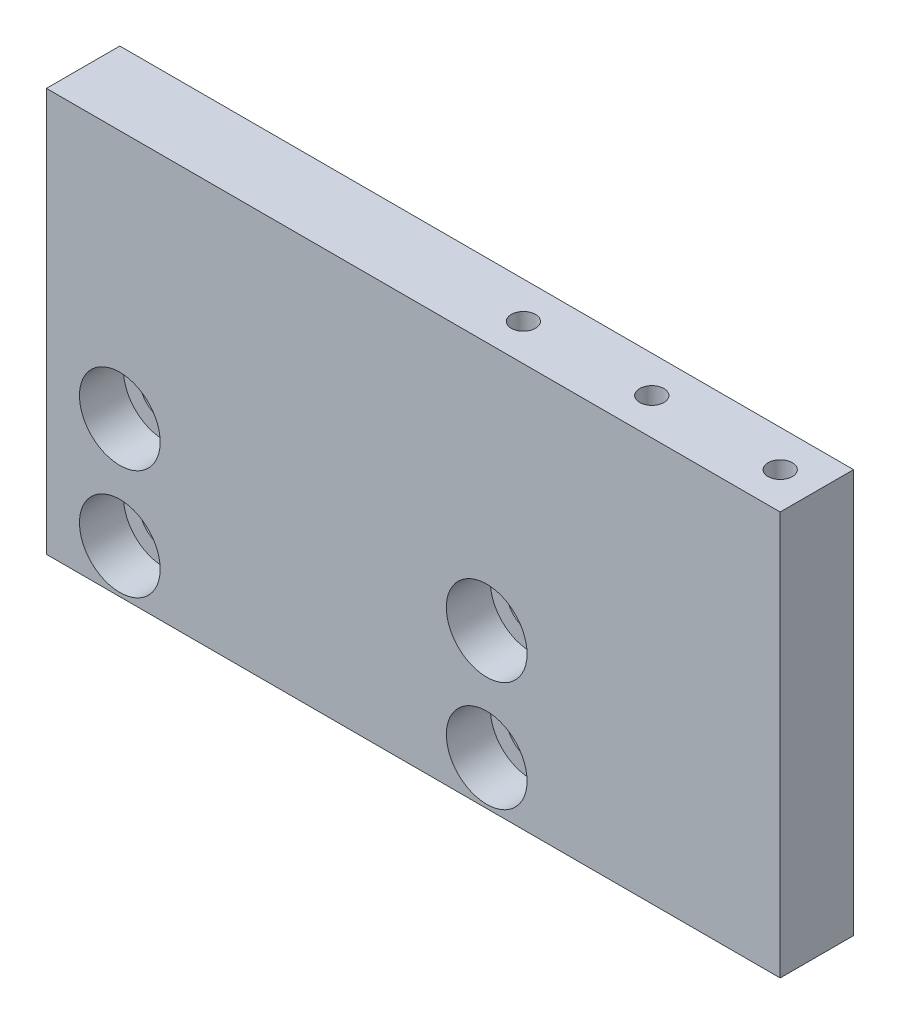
ISO-10303-21;
HEADER;
FILE_DESCRIPTION(('STEP AP214'),'2;1');
FILE_NAME('part.step','',(''),(''),'','','');
FILE_SCHEMA(('AUTOMOTIVE_DESIGN { 1 0 10303 214 1 1 1 1 }'));
ENDSEC;
DATA;
#1=APPLICATION_CONTEXT('core data for automotive mechanical design processes');
#2=APPLICATION_PROTOCOL_DEFINITION('international standard','automotive_design',2000,#1);
#3=PRODUCT_CONTEXT('',#1,'mechanical');
#4=PRODUCT('Part','Part','',(#3));
#5=PRODUCT_RELATED_PRODUCT_CATEGORY('part','',(#4));
#6=PRODUCT_DEFINITION_FORMATION('','',#4);
#7=PRODUCT_DEFINITION_CONTEXT('part definition',#1,'design');
#8=PRODUCT_DEFINITION('design','',#6,#7);
#9=PRODUCT_DEFINITION_SHAPE('','',#8);
#10=(LENGTH_UNIT() NAMED_UNIT(*) SI_UNIT(.MILLI.,.METRE.));
#11=(NAMED_UNIT(*) PLANE_ANGLE_UNIT() SI_UNIT($,.RADIAN.));
#12=(NAMED_UNIT(*) SI_UNIT($,.STERADIAN.) SOLID_ANGLE_UNIT());
#13=UNCERTAINTY_MEASURE_WITH_UNIT(LENGTH_MEASURE(1.E-05),#10,'distance_accuracy_value','');
#14=(GEOMETRIC_REPRESENTATION_CONTEXT(3) GLOBAL_UNCERTAINTY_ASSIGNED_CONTEXT((#13)) GLOBAL_UNIT_ASSIGNED_CONTEXT((#10,
#11,#12)) REPRESENTATION_CONTEXT('',''));
#15=CARTESIAN_POINT('',(0.,0.,0.));
#16=DIRECTION('',(0.,0.,1.));
#17=DIRECTION('',(1.,0.,0.));
#18=AXIS2_PLACEMENT_3D('',#15,#16,#17);
#19=CARTESIAN_POINT('',(-20.,27.5,10.));
#20=DIRECTION('',(1.00000000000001,0.,0.));
#21=DIRECTION('',(0.,1.,0.));
#22=AXIS2_PLACEMENT_3D('',#19,#20,#21);
#23=PLANE('',#22);
#24=DIRECTION('',(0.,-1.,0.));
#25=VECTOR('',#24,1.);
#26=CARTESIAN_POINT('',(-20.,27.5,0.));
#27=LINE('',#26,#25);
#28=CARTESIAN_POINT('',(-20.,27.5,0.));
#29=VERTEX_POINT('',#28);
#30=CARTESIAN_POINT('',(-20.,-27.5000000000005,0.));
#31=VERTEX_POINT('',#30);
#32=EDGE_CURVE('E163',#29,#31,#27,.T.);
#33=ORIENTED_EDGE('',*,*,#32,.T.);
#34=DIRECTION('',(0.,0.,-1.00000000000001));
#35=VECTOR('',#34,1.);
#36=CARTESIAN_POINT('',(-20.,-27.5000000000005,9.99999999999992));
#37=LINE('',#36,#35);
#38=CARTESIAN_POINT('',(-20.,-27.5000000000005,9.99999999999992));
#39=VERTEX_POINT('',#38);
#40=EDGE_CURVE('E13',#39,#31,#37,.T.);
#41=ORIENTED_EDGE('',*,*,#40,.F.);
#42=DIRECTION('',(0.,-1.,0.));
#43=VECTOR('',#42,1.);
#44=CARTESIAN_POINT('',(-20.,27.5,10.));
#45=LINE('',#44,#43);
#46=CARTESIAN_POINT('',(-20.,27.5,10.));
#47=VERTEX_POINT('',#46);
#48=EDGE_CURVE('E172',#47,#39,#45,.T.);
#49=ORIENTED_EDGE('',*,*,#48,.F.);
#50=DIRECTION('',(0.,0.,-1.00000000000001));
#51=VECTOR('',#50,1.);
#52=CARTESIAN_POINT('',(-20.,27.5,10.));
#53=LINE('',#52,#51);
#54=EDGE_CURVE('E178',#47,#29,#53,.T.);
#55=ORIENTED_EDGE('',*,*,#54,.T.);
#56=EDGE_LOOP('',(#33,#41,#49,#55));
#57=FACE_BOUND('',#56,.T.);
#58=ADVANCED_FACE('F42',(#57),#23,.F.);
#59=CARTESIAN_POINT('',(-20.,-27.5000000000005,9.99999999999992));
#60=DIRECTION('',(0.,1.,0.));
#61=DIRECTION('',(-1.00000000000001,0.,0.));
#62=AXIS2_PLACEMENT_3D('',#59,#60,#61);
#63=PLANE('',#62);
#64=DIRECTION('',(1.00000000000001,0.,0.));
#65=VECTOR('',#64,1.);
#66=CARTESIAN_POINT('',(-20.,-27.5000000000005,0.));
#67=LINE('',#66,#65);
#68=CARTESIAN_POINT('',(80.0000000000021,-27.5000000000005,-1.97758476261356E-13));
#69=VERTEX_POINT('',#68);
#70=EDGE_CURVE('E166',#31,#69,#67,.T.);
#71=ORIENTED_EDGE('',*,*,#70,.T.);
#72=DIRECTION('',(0.,0.,-1.00000000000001));
#73=VECTOR('',#72,1.);
#74=CARTESIAN_POINT('',(80.0000000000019,-27.5000000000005,9.99999999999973));
#75=LINE('',#74,#73);
#76=CARTESIAN_POINT('',(80.0000000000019,-27.5000000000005,9.99999999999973));
#77=VERTEX_POINT('',#76);
#78=EDGE_CURVE('E49',#77,#69,#75,.T.);
#79=ORIENTED_EDGE('',*,*,#78,.F.);
#80=DIRECTION('',(1.00000000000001,0.,0.));
#81=VECTOR('',#80,1.);
#82=CARTESIAN_POINT('',(-20.,-27.5000000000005,9.99999999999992));
#83=LINE('',#82,#81);
#84=EDGE_CURVE('E174',#39,#77,#83,.T.);
#85=ORIENTED_EDGE('',*,*,#84,.F.);
#86=ORIENTED_EDGE('',*,*,#40,.T.);
#87=EDGE_LOOP('',(#71,#79,#85,#86));
#88=FACE_BOUND('',#87,.T.);
#89=ADVANCED_FACE('F199',(#88),#63,.F.);
#90=CARTESIAN_POINT('',(80.0000000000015,27.5,9.9999999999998));
#91=DIRECTION('',(-1.00000000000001,0.,0.));
#92=DIRECTION('',(0.,-1.,0.));
#93=AXIS2_PLACEMENT_3D('',#90,#91,#92);
#94=PLANE('',#93);
#95=DIRECTION('',(0.,1.,0.));
#96=VECTOR('',#95,1.);
#97=CARTESIAN_POINT('',(80.0000000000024,27.5,-1.85615411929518E-13));
#98=LINE('',#97,#96);
#99=CARTESIAN_POINT('',(80.0000000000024,27.5,-1.85615411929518E-13));
#100=VERTEX_POINT('',#99);
#101=EDGE_CURVE('E168',#69,#100,#98,.T.);
#102=ORIENTED_EDGE('',*,*,#101,.T.);
#103=DIRECTION('',(0.,0.,-1.00000000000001));
#104=VECTOR('',#103,1.);
#105=CARTESIAN_POINT('',(80.0000000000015,27.5,9.9999999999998));
#106=LINE('',#105,#104);
#107=CARTESIAN_POINT('',(80.0000000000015,27.5,9.9999999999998));
#108=VERTEX_POINT('',#107);
#109=EDGE_CURVE('E181',#108,#100,#106,.T.);
#110=ORIENTED_EDGE('',*,*,#109,.F.);
#111=DIRECTION('',(0.,1.,0.));
#112=VECTOR('',#111,1.);
#113=CARTESIAN_POINT('',(80.0000000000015,27.5,9.9999999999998));
#114=LINE('',#113,#112);
#115=EDGE_CURVE('E61',#77,#108,#114,.T.);
#116=ORIENTED_EDGE('',*,*,#115,.F.);
#117=ORIENTED_EDGE('',*,*,#78,.T.);
#118=EDGE_LOOP('',(#102,#110,#116,#117));
#119=FACE_BOUND('',#118,.T.);
#120=ADVANCED_FACE('F187',(#119),#94,.F.);
#121=CARTESIAN_POINT('',(-20.,27.5,10.));
#122=DIRECTION('',(0.,-1.,0.));
#123=DIRECTION('',(1.00000000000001,0.,0.));
#124=AXIS2_PLACEMENT_3D('',#121,#122,#123);
#125=PLANE('',#124);
#126=CARTESIAN_POINT('',(75.0000000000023,27.5,4.99999999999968));
#127=DIRECTION('',(0.,1.,0.));
#128=DIRECTION('',(0.,0.,1.00000000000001));
#129=AXIS2_PLACEMENT_3D('',#126,#127,#128);
#130=CIRCLE('',#129,1.65);
#131=CARTESIAN_POINT('',(75.0000000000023,27.5,6.64999999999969));
#132=VERTEX_POINT('',#131);
#133=EDGE_CURVE('E98',#132,#132,#130,.T.);
#134=ORIENTED_EDGE('',*,*,#133,.F.);
#135=EDGE_LOOP('',(#134));
#136=FACE_BOUND('',#135,.T.);
#137=CARTESIAN_POINT('',(57.5000000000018,27.5,4.99999999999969));
#138=DIRECTION('',(0.,1.,0.));
#139=DIRECTION('',(0.,0.,1.00000000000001));
#140=AXIS2_PLACEMENT_3D('',#137,#138,#139);
#141=CIRCLE('',#140,1.65);
#142=CARTESIAN_POINT('',(57.5000000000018,27.5,6.64999999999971));
#143=VERTEX_POINT('',#142);
#144=EDGE_CURVE('E106',#143,#143,#141,.T.);
#145=ORIENTED_EDGE('',*,*,#144,.F.);
#146=EDGE_LOOP('',(#145));
#147=FACE_BOUND('',#146,.T.);
#148=CARTESIAN_POINT('',(40.000000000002,27.5,4.99999999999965));
#149=DIRECTION('',(0.,1.,0.));
#150=DIRECTION('',(0.,0.,1.00000000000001));
#151=AXIS2_PLACEMENT_3D('',#148,#149,#150);
#152=CIRCLE('',#151,1.65);
#153=CARTESIAN_POINT('',(40.000000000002,27.5,6.64999999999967));
#154=VERTEX_POINT('',#153);
#155=EDGE_CURVE('E112',#154,#154,#152,.T.);
#156=ORIENTED_EDGE('',*,*,#155,.F.);
#157=EDGE_LOOP('',(#156));
#158=FACE_BOUND('',#157,.T.);
#159=DIRECTION('',(-1.00000000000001,0.,0.));
#160=VECTOR('',#159,1.);
#161=CARTESIAN_POINT('',(-20.,27.5,0.));
#162=LINE('',#161,#160);
#163=EDGE_CURVE('E170',#100,#29,#162,.T.);
#164=ORIENTED_EDGE('',*,*,#163,.T.);
#165=ORIENTED_EDGE('',*,*,#54,.F.);
#166=DIRECTION('',(-1.00000000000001,0.,0.));
#167=VECTOR('',#166,1.);
#168=CARTESIAN_POINT('',(-20.,27.5,10.));
#169=LINE('',#168,#167);
#170=EDGE_CURVE('E56',#108,#47,#169,.T.);
#171=ORIENTED_EDGE('',*,*,#170,.F.);
#172=ORIENTED_EDGE('',*,*,#109,.T.);
#173=EDGE_LOOP('',(#164,#165,#171,#172));
#174=FACE_BOUND('',#173,.T.);
#175=ADVANCED_FACE('F194',(#136,#147,#158,#174),#125,.F.);
#176=CARTESIAN_POINT('',(-20.,27.5,10.));
#177=DIRECTION('',(0.,0.,1.00000000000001));
#178=DIRECTION('',(1.00000000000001,0.,0.));
#179=AXIS2_PLACEMENT_3D('',#176,#177,#178);
#180=PLANE('',#179);
#181=CARTESIAN_POINT('',(40.,-21.5000000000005,9.99999999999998));
#182=DIRECTION('',(0.,0.,1.00000000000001));
#183=DIRECTION('',(1.00000000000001,0.,0.));
#184=AXIS2_PLACEMENT_3D('',#181,#182,#183);
#185=CIRCLE('',#184,5.5);
#186=CARTESIAN_POINT('',(45.5000000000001,-21.5000000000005,9.99999999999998));
#187=VERTEX_POINT('',#186);
#188=EDGE_CURVE('E124',#187,#187,#185,.T.);
#189=ORIENTED_EDGE('',*,*,#188,.F.);
#190=EDGE_LOOP('',(#189));
#191=FACE_BOUND('',#190,.T.);
#192=CARTESIAN_POINT('',(40.0000000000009,-6.5,10.));
#193=DIRECTION('',(0.,0.,1.00000000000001));
#194=DIRECTION('',(1.00000000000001,0.,0.));
#195=AXIS2_PLACEMENT_3D('',#192,#193,#194);
#196=CIRCLE('',#195,5.5);
#197=CARTESIAN_POINT('',(45.500000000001,-6.5,10.));
#198=VERTEX_POINT('',#197);
#199=EDGE_CURVE('E136',#198,#198,#196,.T.);
#200=ORIENTED_EDGE('',*,*,#199,.F.);
#201=EDGE_LOOP('',(#200));
#202=FACE_BOUND('',#201,.T.);
#203=CARTESIAN_POINT('',(-10.,-6.49999999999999,9.99999999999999));
#204=DIRECTION('',(0.,0.,1.00000000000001));
#205=DIRECTION('',(1.00000000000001,0.,0.));
#206=AXIS2_PLACEMENT_3D('',#203,#204,#205);
#207=CIRCLE('',#206,5.49999999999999);
#208=CARTESIAN_POINT('',(-4.49999999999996,-6.49999999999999,9.99999999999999));
#209=VERTEX_POINT('',#208);
#210=EDGE_CURVE('E148',#209,#209,#207,.T.);
#211=ORIENTED_EDGE('',*,*,#210,.F.);
#212=EDGE_LOOP('',(#211));
#213=FACE_BOUND('',#212,.T.);
#214=CARTESIAN_POINT('',(-9.99999999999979,-21.5000000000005,9.99999999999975));
#215=DIRECTION('',(0.,0.,1.00000000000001));
#216=DIRECTION('',(1.00000000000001,0.,0.));
#217=AXIS2_PLACEMENT_3D('',#214,#215,#216);
#218=CIRCLE('',#217,5.49999999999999);
#219=CARTESIAN_POINT('',(-4.49999999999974,-21.5000000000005,9.99999999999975));
#220=VERTEX_POINT('',#219);
#221=EDGE_CURVE('E160',#220,#220,#218,.T.);
#222=ORIENTED_EDGE('',*,*,#221,.F.);
#223=EDGE_LOOP('',(#222));
#224=FACE_BOUND('',#223,.T.);
#225=ORIENTED_EDGE('',*,*,#48,.T.);
#226=ORIENTED_EDGE('',*,*,#84,.T.);
#227=ORIENTED_EDGE('',*,*,#115,.T.);
#228=ORIENTED_EDGE('',*,*,#170,.T.);
#229=EDGE_LOOP('',(#225,#226,#227,#228));
#230=FACE_BOUND('',#229,.T.);
#231=ADVANCED_FACE('F198',(#191,#202,#213,#224,#230),#180,.T.);
#232=CARTESIAN_POINT('',(-20.,27.5,0.));
#233=DIRECTION('',(0.,0.,1.00000000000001));
#234=DIRECTION('',(1.00000000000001,0.,0.));
#235=AXIS2_PLACEMENT_3D('',#232,#233,#234);
#236=PLANE('',#235);
#237=CARTESIAN_POINT('',(40.0000000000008,-21.5000000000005,0.));
#238=DIRECTION('',(0.,0.,1.00000000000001));
#239=DIRECTION('',(1.00000000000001,0.,0.));
#240=AXIS2_PLACEMENT_3D('',#237,#238,#239);
#241=CIRCLE('',#240,3.3);
#242=CARTESIAN_POINT('',(43.3000000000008,-21.5000000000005,0.));
#243=VERTEX_POINT('',#242);
#244=EDGE_CURVE('E115',#243,#243,#241,.T.);
#245=ORIENTED_EDGE('',*,*,#244,.T.);
#246=EDGE_LOOP('',(#245));
#247=FACE_BOUND('',#246,.T.);
#248=CARTESIAN_POINT('',(40.0000000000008,-6.50000000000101,-2.08166817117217E-13));
#249=DIRECTION('',(0.,0.,1.00000000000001));
#250=DIRECTION('',(1.00000000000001,0.,0.));
#251=AXIS2_PLACEMENT_3D('',#248,#249,#250);
#252=CIRCLE('',#251,3.3);
#253=CARTESIAN_POINT('',(43.3000000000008,-6.50000000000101,-2.07846240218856E-13));
#254=VERTEX_POINT('',#253);
#255=EDGE_CURVE('E127',#254,#254,#252,.T.);
#256=ORIENTED_EDGE('',*,*,#255,.T.);
#257=EDGE_LOOP('',(#256));
#258=FACE_BOUND('',#257,.T.);
#259=CARTESIAN_POINT('',(-9.99999999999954,-6.49999999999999,-3.52148865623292E-13));
#260=DIRECTION('',(0.,0.,1.00000000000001));
#261=DIRECTION('',(1.00000000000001,0.,0.));
#262=AXIS2_PLACEMENT_3D('',#259,#260,#261);
#263=CIRCLE('',#262,3.3);
#264=CARTESIAN_POINT('',(-6.69999999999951,-6.49999999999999,-3.51828288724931E-13));
#265=VERTEX_POINT('',#264);
#266=EDGE_CURVE('E139',#265,#265,#263,.T.);
#267=ORIENTED_EDGE('',*,*,#266,.T.);
#268=EDGE_LOOP('',(#267));
#269=FACE_BOUND('',#268,.T.);
#270=CARTESIAN_POINT('',(-9.99999999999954,-21.5000000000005,-3.52148865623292E-13));
#271=DIRECTION('',(0.,0.,1.00000000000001));
#272=DIRECTION('',(1.00000000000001,0.,0.));
#273=AXIS2_PLACEMENT_3D('',#270,#271,#272);
#274=CIRCLE('',#273,3.3);
#275=CARTESIAN_POINT('',(-6.69999999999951,-21.5000000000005,-3.51828288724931E-13));
#276=VERTEX_POINT('',#275);
#277=EDGE_CURVE('E151',#276,#276,#274,.T.);
#278=ORIENTED_EDGE('',*,*,#277,.T.);
#279=EDGE_LOOP('',(#278));
#280=FACE_BOUND('',#279,.T.);
#281=ORIENTED_EDGE('',*,*,#32,.F.);
#282=ORIENTED_EDGE('',*,*,#163,.F.);
#283=ORIENTED_EDGE('',*,*,#101,.F.);
#284=ORIENTED_EDGE('',*,*,#70,.F.);
#285=EDGE_LOOP('',(#281,#282,#283,#284));
#286=FACE_BOUND('',#285,.T.);
#287=ADVANCED_FACE('F192',(#247,#258,#269,#280,#286),#236,.F.);
#288=CARTESIAN_POINT('',(-9.99999999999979,-21.5000000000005,9.99999999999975));
#289=DIRECTION('',(0.,0.,1.00000000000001));
#290=DIRECTION('',(1.00000000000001,0.,0.));
#291=AXIS2_PLACEMENT_3D('',#288,#289,#290);
#292=CYLINDRICAL_SURFACE('',#291,5.5);
#293=CARTESIAN_POINT('',(-9.99999999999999,-21.5000000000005,4.));
#294=DIRECTION('',(0.,0.,1.00000000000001));
#295=DIRECTION('',(1.00000000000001,0.,0.));
#296=AXIS2_PLACEMENT_3D('',#293,#294,#295);
#297=CIRCLE('',#296,5.5);
#298=CARTESIAN_POINT('',(-4.49999999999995,-21.5000000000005,4.));
#299=VERTEX_POINT('',#298);
#300=EDGE_CURVE('E157',#299,#299,#297,.T.);
#301=ORIENTED_EDGE('',*,*,#300,.F.);
#302=EDGE_LOOP('',(#301));
#303=FACE_BOUND('',#302,.T.);
#304=ORIENTED_EDGE('',*,*,#221,.T.);
#305=EDGE_LOOP('',(#304));
#306=FACE_BOUND('',#305,.T.);
#307=ADVANCED_FACE('F215',(#303,#306),#292,.F.);
#308=CARTESIAN_POINT('',(-6.69999999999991,-21.5000000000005,3.99999999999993));
#309=DIRECTION('',(0.,0.,-1.00000000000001));
#310=DIRECTION('',(-1.00000000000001,0.,0.));
#311=AXIS2_PLACEMENT_3D('',#308,#309,#310);
#312=PLANE('',#311);
#313=CARTESIAN_POINT('',(-9.99999999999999,-21.5000000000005,4.));
#314=DIRECTION('',(0.,0.,1.00000000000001));
#315=DIRECTION('',(1.00000000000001,0.,0.));
#316=AXIS2_PLACEMENT_3D('',#313,#314,#315);
#317=CIRCLE('',#316,3.3);
#318=CARTESIAN_POINT('',(-6.69999999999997,-21.5000000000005,4.));
#319=VERTEX_POINT('',#318);
#320=EDGE_CURVE('E154',#319,#319,#317,.T.);
#321=ORIENTED_EDGE('',*,*,#320,.F.);
#322=EDGE_LOOP('',(#321));
#323=FACE_BOUND('',#322,.T.);
#324=ORIENTED_EDGE('',*,*,#300,.T.);
#325=EDGE_LOOP('',(#324));
#326=FACE_BOUND('',#325,.T.);
#327=ADVANCED_FACE('F219',(#323,#326),#312,.F.);
#328=CARTESIAN_POINT('',(-9.99999999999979,-21.5000000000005,9.99999999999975));
#329=DIRECTION('',(0.,0.,1.00000000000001));
#330=DIRECTION('',(1.00000000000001,0.,0.));
#331=AXIS2_PLACEMENT_3D('',#328,#329,#330);
#332=CYLINDRICAL_SURFACE('',#331,3.3);
#333=ORIENTED_EDGE('',*,*,#277,.F.);
#334=EDGE_LOOP('',(#333));
#335=FACE_BOUND('',#334,.T.);
#336=ORIENTED_EDGE('',*,*,#320,.T.);
#337=EDGE_LOOP('',(#336));
#338=FACE_BOUND('',#337,.T.);
#339=ADVANCED_FACE('F223',(#335,#338),#332,.F.);
#340=CARTESIAN_POINT('',(-10.,-6.49999999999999,9.99999999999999));
#341=DIRECTION('',(0.,0.,1.00000000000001));
#342=DIRECTION('',(1.00000000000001,0.,0.));
#343=AXIS2_PLACEMENT_3D('',#340,#341,#342);
#344=CYLINDRICAL_SURFACE('',#343,5.5);
#345=CARTESIAN_POINT('',(-10.,-6.49999999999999,4.));
#346=DIRECTION('',(0.,0.,1.00000000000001));
#347=DIRECTION('',(1.00000000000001,0.,0.));
#348=AXIS2_PLACEMENT_3D('',#345,#346,#347);
#349=CIRCLE('',#348,5.5);
#350=CARTESIAN_POINT('',(-4.49999999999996,-6.49999999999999,4.));
#351=VERTEX_POINT('',#350);
#352=EDGE_CURVE('E145',#351,#351,#349,.T.);
#353=ORIENTED_EDGE('',*,*,#352,.F.);
#354=EDGE_LOOP('',(#353));
#355=FACE_BOUND('',#354,.T.);
#356=ORIENTED_EDGE('',*,*,#210,.T.);
#357=EDGE_LOOP('',(#356));
#358=FACE_BOUND('',#357,.T.);
#359=ADVANCED_FACE('F227',(#355,#358),#344,.F.);
#360=CARTESIAN_POINT('',(-6.7,-6.49999999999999,4.));
#361=DIRECTION('',(0.,0.,-1.00000000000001));
#362=DIRECTION('',(-1.00000000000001,0.,0.));
#363=AXIS2_PLACEMENT_3D('',#360,#361,#362);
#364=PLANE('',#363);
#365=CARTESIAN_POINT('',(-10.,-6.49999999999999,4.));
#366=DIRECTION('',(0.,0.,1.00000000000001));
#367=DIRECTION('',(1.00000000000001,0.,0.));
#368=AXIS2_PLACEMENT_3D('',#365,#366,#367);
#369=CIRCLE('',#368,3.3);
#370=CARTESIAN_POINT('',(-6.69999999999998,-6.49999999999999,4.));
#371=VERTEX_POINT('',#370);
#372=EDGE_CURVE('E142',#371,#371,#369,.T.);
#373=ORIENTED_EDGE('',*,*,#372,.F.);
#374=EDGE_LOOP('',(#373));
#375=FACE_BOUND('',#374,.T.);
#376=ORIENTED_EDGE('',*,*,#352,.T.);
#377=EDGE_LOOP('',(#376));
#378=FACE_BOUND('',#377,.T.);
#379=ADVANCED_FACE('F231',(#375,#378),#364,.F.);
#380=CARTESIAN_POINT('',(-10.,-6.49999999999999,9.99999999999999));
#381=DIRECTION('',(0.,0.,1.00000000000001));
#382=DIRECTION('',(1.00000000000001,0.,0.));
#383=AXIS2_PLACEMENT_3D('',#380,#381,#382);
#384=CYLINDRICAL_SURFACE('',#383,3.3);
#385=ORIENTED_EDGE('',*,*,#266,.F.);
#386=EDGE_LOOP('',(#385));
#387=FACE_BOUND('',#386,.T.);
#388=ORIENTED_EDGE('',*,*,#372,.T.);
#389=EDGE_LOOP('',(#388));
#390=FACE_BOUND('',#389,.T.);
#391=ADVANCED_FACE('F235',(#387,#390),#384,.F.);
#392=CARTESIAN_POINT('',(40.0000000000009,-6.5,10.));
#393=DIRECTION('',(0.,0.,1.00000000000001));
#394=DIRECTION('',(1.00000000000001,0.,0.));
#395=AXIS2_PLACEMENT_3D('',#392,#393,#394);
#396=CYLINDRICAL_SURFACE('',#395,5.5);
#397=CARTESIAN_POINT('',(40.0000000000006,-6.50000000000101,3.99999999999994));
#398=DIRECTION('',(0.,0.,1.00000000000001));
#399=DIRECTION('',(1.00000000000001,0.,0.));
#400=AXIS2_PLACEMENT_3D('',#397,#398,#399);
#401=CIRCLE('',#400,5.5);
#402=CARTESIAN_POINT('',(45.5000000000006,-6.50000000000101,3.99999999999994));
#403=VERTEX_POINT('',#402);
#404=EDGE_CURVE('E133',#403,#403,#401,.T.);
#405=ORIENTED_EDGE('',*,*,#404,.F.);
#406=EDGE_LOOP('',(#405));
#407=FACE_BOUND('',#406,.T.);
#408=ORIENTED_EDGE('',*,*,#199,.T.);
#409=EDGE_LOOP('',(#408));
#410=FACE_BOUND('',#409,.T.);
#411=ADVANCED_FACE('F239',(#407,#410),#396,.F.);
#412=CARTESIAN_POINT('',(43.3000000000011,-6.50000000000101,4.00000000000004));
#413=DIRECTION('',(0.,0.,-1.00000000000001));
#414=DIRECTION('',(-1.00000000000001,0.,0.));
#415=AXIS2_PLACEMENT_3D('',#412,#413,#414);
#416=PLANE('',#415);
#417=CARTESIAN_POINT('',(40.0000000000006,-6.50000000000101,3.99999999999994));
#418=DIRECTION('',(0.,0.,1.00000000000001));
#419=DIRECTION('',(1.00000000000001,0.,0.));
#420=AXIS2_PLACEMENT_3D('',#417,#418,#419);
#421=CIRCLE('',#420,3.3);
#422=CARTESIAN_POINT('',(43.3000000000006,-6.50000000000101,3.99999999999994));
#423=VERTEX_POINT('',#422);
#424=EDGE_CURVE('E130',#423,#423,#421,.T.);
#425=ORIENTED_EDGE('',*,*,#424,.F.);
#426=EDGE_LOOP('',(#425));
#427=FACE_BOUND('',#426,.T.);
#428=ORIENTED_EDGE('',*,*,#404,.T.);
#429=EDGE_LOOP('',(#428));
#430=FACE_BOUND('',#429,.T.);
#431=ADVANCED_FACE('F243',(#427,#430),#416,.F.);
#432=CARTESIAN_POINT('',(40.0000000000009,-6.5,10.));
#433=DIRECTION('',(0.,0.,1.00000000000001));
#434=DIRECTION('',(1.00000000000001,0.,0.));
#435=AXIS2_PLACEMENT_3D('',#432,#433,#434);
#436=CYLINDRICAL_SURFACE('',#435,3.3);
#437=ORIENTED_EDGE('',*,*,#255,.F.);
#438=EDGE_LOOP('',(#437));
#439=FACE_BOUND('',#438,.T.);
#440=ORIENTED_EDGE('',*,*,#424,.T.);
#441=EDGE_LOOP('',(#440));
#442=FACE_BOUND('',#441,.T.);
#443=ADVANCED_FACE('F247',(#439,#442),#436,.F.);
#444=CARTESIAN_POINT('',(40.,-21.5000000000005,9.99999999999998));
#445=DIRECTION('',(0.,0.,1.00000000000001));
#446=DIRECTION('',(1.00000000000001,0.,0.));
#447=AXIS2_PLACEMENT_3D('',#444,#445,#446);
#448=CYLINDRICAL_SURFACE('',#447,5.5);
#449=CARTESIAN_POINT('',(40.0000000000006,-21.5000000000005,3.99999999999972));
#450=DIRECTION('',(0.,0.,1.00000000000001));
#451=DIRECTION('',(1.00000000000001,0.,0.));
#452=AXIS2_PLACEMENT_3D('',#449,#450,#451);
#453=CIRCLE('',#452,5.5);
#454=CARTESIAN_POINT('',(45.5000000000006,-21.5000000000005,3.99999999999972));
#455=VERTEX_POINT('',#454);
#456=EDGE_CURVE('E121',#455,#455,#453,.T.);
#457=ORIENTED_EDGE('',*,*,#456,.F.);
#458=EDGE_LOOP('',(#457));
#459=FACE_BOUND('',#458,.T.);
#460=ORIENTED_EDGE('',*,*,#188,.T.);
#461=EDGE_LOOP('',(#460));
#462=FACE_BOUND('',#461,.T.);
#463=ADVANCED_FACE('F251',(#459,#462),#448,.F.);
#464=CARTESIAN_POINT('',(43.3000000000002,-21.5000000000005,3.99999999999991));
#465=DIRECTION('',(0.,0.,-1.00000000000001));
#466=DIRECTION('',(-1.00000000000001,0.,0.));
#467=AXIS2_PLACEMENT_3D('',#464,#465,#466);
#468=PLANE('',#467);
#469=CARTESIAN_POINT('',(40.0000000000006,-21.5000000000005,3.99999999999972));
#470=DIRECTION('',(0.,0.,1.00000000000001));
#471=DIRECTION('',(1.00000000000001,0.,0.));
#472=AXIS2_PLACEMENT_3D('',#469,#470,#471);
#473=CIRCLE('',#472,3.3);
#474=CARTESIAN_POINT('',(43.3000000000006,-21.5000000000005,3.99999999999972));
#475=VERTEX_POINT('',#474);
#476=EDGE_CURVE('E118',#475,#475,#473,.T.);
#477=ORIENTED_EDGE('',*,*,#476,.F.);
#478=EDGE_LOOP('',(#477));
#479=FACE_BOUND('',#478,.T.);
#480=ORIENTED_EDGE('',*,*,#456,.T.);
#481=EDGE_LOOP('',(#480));
#482=FACE_BOUND('',#481,.T.);
#483=ADVANCED_FACE('F255',(#479,#482),#468,.F.);
#484=CARTESIAN_POINT('',(40.,-21.5000000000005,9.99999999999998));
#485=DIRECTION('',(0.,0.,1.00000000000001));
#486=DIRECTION('',(1.00000000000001,0.,0.));
#487=AXIS2_PLACEMENT_3D('',#484,#485,#486);
#488=CYLINDRICAL_SURFACE('',#487,3.3);
#489=ORIENTED_EDGE('',*,*,#244,.F.);
#490=EDGE_LOOP('',(#489));
#491=FACE_BOUND('',#490,.T.);
#492=ORIENTED_EDGE('',*,*,#476,.T.);
#493=EDGE_LOOP('',(#492));
#494=FACE_BOUND('',#493,.T.);
#495=ADVANCED_FACE('F259',(#491,#494),#488,.F.);
#496=CARTESIAN_POINT('',(40.000000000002,27.5,4.99999999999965));
#497=DIRECTION('',(0.,1.,0.));
#498=DIRECTION('',(0.,0.,1.00000000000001));
#499=AXIS2_PLACEMENT_3D('',#496,#497,#498);
#500=CYLINDRICAL_SURFACE('',#499,1.65);
#501=CARTESIAN_POINT('',(40.000000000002,17.5,4.99999999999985));
#502=DIRECTION('',(0.,1.,0.));
#503=DIRECTION('',(0.,0.,1.00000000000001));
#504=AXIS2_PLACEMENT_3D('',#501,#502,#503);
#505=CIRCLE('',#504,1.65);
#506=CARTESIAN_POINT('',(40.000000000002,17.5,6.64999999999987));
#507=VERTEX_POINT('',#506);
#508=EDGE_CURVE('E109',#507,#507,#505,.T.);
#509=ORIENTED_EDGE('',*,*,#508,.F.);
#510=EDGE_LOOP('',(#509));
#511=FACE_BOUND('',#510,.T.);
#512=ORIENTED_EDGE('',*,*,#155,.T.);
#513=EDGE_LOOP('',(#512));
#514=FACE_BOUND('',#513,.T.);
#515=ADVANCED_FACE('F263',(#511,#514),#500,.F.);
#516=CARTESIAN_POINT('',(40.000000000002,17.5,4.99999999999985));
#517=DIRECTION('',(0.,1.,0.));
#518=DIRECTION('',(0.,0.,1.00000000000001));
#519=AXIS2_PLACEMENT_3D('',#516,#517,#518);
#520=CONICAL_SURFACE('',#519,1.65,1.02974425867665);
#521=CARTESIAN_POINT('',(40.000000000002,16.5085799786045,4.99999999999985));
#522=VERTEX_POINT('',#521);
#523=VERTEX_LOOP('',#522);
#524=FACE_BOUND('',#523,.T.);
#525=ORIENTED_EDGE('',*,*,#508,.T.);
#526=EDGE_LOOP('',(#525));
#527=FACE_BOUND('',#526,.T.);
#528=ADVANCED_FACE('F267',(#524,#527),#520,.F.);
#529=CARTESIAN_POINT('',(57.5000000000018,27.5,4.99999999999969));
#530=DIRECTION('',(0.,1.,0.));
#531=DIRECTION('',(0.,0.,1.00000000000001));
#532=AXIS2_PLACEMENT_3D('',#529,#530,#531);
#533=CYLINDRICAL_SURFACE('',#532,1.65);
#534=CARTESIAN_POINT('',(57.5000000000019,17.5,4.99999999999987));
#535=DIRECTION('',(0.,1.,0.));
#536=DIRECTION('',(0.,0.,1.00000000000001));
#537=AXIS2_PLACEMENT_3D('',#534,#535,#536);
#538=CIRCLE('',#537,1.65);
#539=CARTESIAN_POINT('',(57.5000000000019,17.5,6.64999999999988));
#540=VERTEX_POINT('',#539);
#541=EDGE_CURVE('E101',#540,#540,#538,.T.);
#542=ORIENTED_EDGE('',*,*,#541,.F.);
#543=EDGE_LOOP('',(#542));
#544=FACE_BOUND('',#543,.T.);
#545=ORIENTED_EDGE('',*,*,#144,.T.);
#546=EDGE_LOOP('',(#545));
#547=FACE_BOUND('',#546,.T.);
#548=ADVANCED_FACE('F271',(#544,#547),#533,.F.);
#549=CARTESIAN_POINT('',(57.5000000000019,17.5,4.99999999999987));
#550=DIRECTION('',(0.,1.,0.));
#551=DIRECTION('',(0.,0.,1.00000000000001));
#552=AXIS2_PLACEMENT_3D('',#549,#550,#551);
#553=CONICAL_SURFACE('',#552,1.65,1.02974425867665);
#554=CARTESIAN_POINT('',(57.5000000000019,16.5085799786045,4.99999999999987));
#555=VERTEX_POINT('',#554);
#556=VERTEX_LOOP('',#555);
#557=FACE_BOUND('',#556,.T.);
#558=ORIENTED_EDGE('',*,*,#541,.T.);
#559=EDGE_LOOP('',(#558));
#560=FACE_BOUND('',#559,.T.);
#561=ADVANCED_FACE('F275',(#557,#560),#553,.F.);
#562=CARTESIAN_POINT('',(75.0000000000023,27.5,4.99999999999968));
#563=DIRECTION('',(0.,1.,0.));
#564=DIRECTION('',(0.,0.,1.00000000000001));
#565=AXIS2_PLACEMENT_3D('',#562,#563,#564);
#566=CYLINDRICAL_SURFACE('',#565,1.65);
#567=CARTESIAN_POINT('',(75.0000000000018,17.5,5.00000000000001));
#568=DIRECTION('',(0.,1.,0.));
#569=DIRECTION('',(0.,0.,1.00000000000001));
#570=AXIS2_PLACEMENT_3D('',#567,#568,#569);
#571=CIRCLE('',#570,1.65);
#572=CARTESIAN_POINT('',(75.0000000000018,17.5,6.65000000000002));
#573=VERTEX_POINT('',#572);
#574=EDGE_CURVE('E96',#573,#573,#571,.T.);
#575=ORIENTED_EDGE('',*,*,#574,.F.);
#576=EDGE_LOOP('',(#575));
#577=FACE_BOUND('',#576,.T.);
#578=ORIENTED_EDGE('',*,*,#133,.T.);
#579=EDGE_LOOP('',(#578));
#580=FACE_BOUND('',#579,.T.);
#581=ADVANCED_FACE('F92',(#577,#580),#566,.F.);
#582=CARTESIAN_POINT('',(75.0000000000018,17.5,5.00000000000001));
#583=DIRECTION('',(0.,1.,0.));
#584=DIRECTION('',(0.,0.,1.00000000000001));
#585=AXIS2_PLACEMENT_3D('',#582,#583,#584);
#586=CONICAL_SURFACE('',#585,1.65,1.02974425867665);
#587=CARTESIAN_POINT('',(75.0000000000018,16.5085799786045,5.00000000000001));
#588=VERTEX_POINT('',#587);
#589=VERTEX_LOOP('',#588);
#590=FACE_BOUND('',#589,.T.);
#591=ORIENTED_EDGE('',*,*,#574,.T.);
#592=EDGE_LOOP('',(#591));
#593=FACE_BOUND('',#592,.T.);
#594=ADVANCED_FACE('F89',(#590,#593),#586,.F.);
#595=CLOSED_SHELL('',(#58,#89,#120,#175,#231,#287,#307,#327,#339,#359,#379,#391,#411,#431,#443,
#463,#483,#495,#515,#528,#548,#561,#581,#594));
#596=MANIFOLD_SOLID_BREP('B2',#595);
#597=ADVANCED_BREP_SHAPE_REPRESENTATION('',(#18,#596),#14);
#598=SHAPE_DEFINITION_REPRESENTATION(#9,#597);
ENDSEC;
END-ISO-10303-21;
